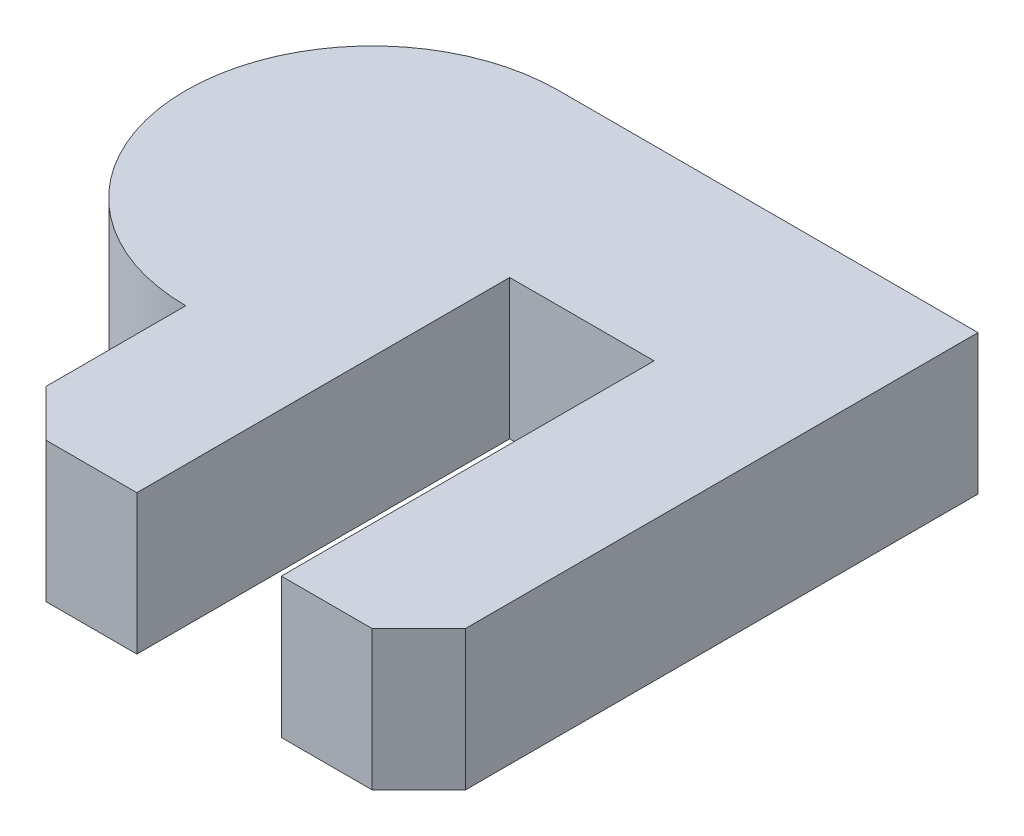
ISO-10303-21;
HEADER;
FILE_DESCRIPTION(('STEP AP214'),'2;1');
FILE_NAME('part.step','',(''),(''),'','','');
FILE_SCHEMA(('AUTOMOTIVE_DESIGN { 1 0 10303 214 1 1 1 1 }'));
ENDSEC;
DATA;
#1=APPLICATION_CONTEXT('core data for automotive mechanical design processes');
#2=APPLICATION_PROTOCOL_DEFINITION('international standard','automotive_design',2000,#1);
#3=PRODUCT_CONTEXT('',#1,'mechanical');
#4=PRODUCT('Part','Part','',(#3));
#5=PRODUCT_RELATED_PRODUCT_CATEGORY('part','',(#4));
#6=PRODUCT_DEFINITION_FORMATION('','',#4);
#7=PRODUCT_DEFINITION_CONTEXT('part definition',#1,'design');
#8=PRODUCT_DEFINITION('design','',#6,#7);
#9=PRODUCT_DEFINITION_SHAPE('','',#8);
#10=(LENGTH_UNIT() NAMED_UNIT(*) SI_UNIT(.MILLI.,.METRE.));
#11=(NAMED_UNIT(*) PLANE_ANGLE_UNIT() SI_UNIT($,.RADIAN.));
#12=(NAMED_UNIT(*) SI_UNIT($,.STERADIAN.) SOLID_ANGLE_UNIT());
#13=UNCERTAINTY_MEASURE_WITH_UNIT(LENGTH_MEASURE(1.E-05),#10,'distance_accuracy_value','');
#14=(GEOMETRIC_REPRESENTATION_CONTEXT(3) GLOBAL_UNCERTAINTY_ASSIGNED_CONTEXT((#13)) GLOBAL_UNIT_ASSIGNED_CONTEXT((#10,
#11,#12)) REPRESENTATION_CONTEXT('',''));
#15=CARTESIAN_POINT('',(0.,0.,0.));
#16=DIRECTION('',(0.,0.,1.));
#17=DIRECTION('',(1.,0.,0.));
#18=AXIS2_PLACEMENT_3D('',#15,#16,#17);
#19=CARTESIAN_POINT('',(4.5,3.,-6.));
#20=DIRECTION('',(0.,-1.,0.));
#21=DIRECTION('',(0.,0.,-1.));
#22=AXIS2_PLACEMENT_3D('',#19,#20,#21);
#23=PLANE('',#22);
#24=DIRECTION('',(-0.707106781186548,0.,0.707106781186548));
#25=VECTOR('',#24,1.);
#26=CARTESIAN_POINT('',(10.,3.,-0.500000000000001));
#27=LINE('',#26,#25);
#28=CARTESIAN_POINT('',(4.5,3.,5.));
#29=VERTEX_POINT('',#28);
#30=CARTESIAN_POINT('',(3.5,3.,6.));
#31=VERTEX_POINT('',#30);
#32=EDGE_CURVE('E116',#29,#31,#27,.T.);
#33=ORIENTED_EDGE('',*,*,#32,.F.);
#34=DIRECTION('',(0.,0.,-1.));
#35=VECTOR('',#34,1.);
#36=CARTESIAN_POINT('',(4.5,3.,6.));
#37=LINE('',#36,#35);
#38=CARTESIAN_POINT('',(4.5,3.,-6.));
#39=VERTEX_POINT('',#38);
#40=EDGE_CURVE('E137',#29,#39,#37,.T.);
#41=ORIENTED_EDGE('',*,*,#40,.T.);
#42=DIRECTION('',(-1.,0.,0.));
#43=VECTOR('',#42,1.);
#44=CARTESIAN_POINT('',(-4.5,3.,-6.));
#45=LINE('',#44,#43);
#46=CARTESIAN_POINT('',(-4.5,3.,-6.));
#47=VERTEX_POINT('',#46);
#48=EDGE_CURVE('E152',#39,#47,#45,.T.);
#49=ORIENTED_EDGE('',*,*,#48,.T.);
#50=CARTESIAN_POINT('',(-4.5,3.,-2.));
#51=DIRECTION('',(0.,1.,0.));
#52=DIRECTION('',(0.,0.,1.));
#53=AXIS2_PLACEMENT_3D('',#50,#51,#52);
#54=CIRCLE('',#53,4.);
#55=CARTESIAN_POINT('',(-4.5,3.,2.));
#56=VERTEX_POINT('',#55);
#57=EDGE_CURVE('E194',#47,#56,#54,.T.);
#58=ORIENTED_EDGE('',*,*,#57,.T.);
#59=DIRECTION('',(0.,0.,1.));
#60=VECTOR('',#59,1.);
#61=CARTESIAN_POINT('',(-4.5,3.,6.));
#62=LINE('',#61,#60);
#63=CARTESIAN_POINT('',(-4.5,3.,5.));
#64=VERTEX_POINT('',#63);
#65=EDGE_CURVE('E163',#56,#64,#62,.T.);
#66=ORIENTED_EDGE('',*,*,#65,.T.);
#67=DIRECTION('',(-0.707106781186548,0.,-0.707106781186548));
#68=VECTOR('',#67,1.);
#69=CARTESIAN_POINT('',(-5.5,3.,4.));
#70=LINE('',#69,#68);
#71=CARTESIAN_POINT('',(-3.5,3.,6.));
#72=VERTEX_POINT('',#71);
#73=EDGE_CURVE('E196',#72,#64,#70,.T.);
#74=ORIENTED_EDGE('',*,*,#73,.F.);
#75=DIRECTION('',(1.,0.,0.));
#76=VECTOR('',#75,1.);
#77=CARTESIAN_POINT('',(-4.5,3.,6.));
#78=LINE('',#77,#76);
#79=CARTESIAN_POINT('',(-1.55,3.,6.));
#80=VERTEX_POINT('',#79);
#81=EDGE_CURVE('E145',#72,#80,#78,.T.);
#82=ORIENTED_EDGE('',*,*,#81,.T.);
#83=DIRECTION('',(0.,0.,1.));
#84=VECTOR('',#83,1.);
#85=CARTESIAN_POINT('',(-1.55,3.,-2.));
#86=LINE('',#85,#84);
#87=CARTESIAN_POINT('',(-1.55,3.,-2.));
#88=VERTEX_POINT('',#87);
#89=EDGE_CURVE('E176',#88,#80,#86,.T.);
#90=ORIENTED_EDGE('',*,*,#89,.F.);
#91=DIRECTION('',(-1.,0.,0.));
#92=VECTOR('',#91,1.);
#93=CARTESIAN_POINT('',(-1.55,3.,-2.));
#94=LINE('',#93,#92);
#95=CARTESIAN_POINT('',(1.55,3.,-2.));
#96=VERTEX_POINT('',#95);
#97=EDGE_CURVE('E189',#96,#88,#94,.T.);
#98=ORIENTED_EDGE('',*,*,#97,.F.);
#99=DIRECTION('',(0.,0.,-1.));
#100=VECTOR('',#99,1.);
#101=CARTESIAN_POINT('',(1.55,3.,-2.));
#102=LINE('',#101,#100);
#103=CARTESIAN_POINT('',(1.55,3.,6.));
#104=VERTEX_POINT('',#103);
#105=EDGE_CURVE('E180',#104,#96,#102,.T.);
#106=ORIENTED_EDGE('',*,*,#105,.F.);
#107=EDGE_CURVE('E162',#104,#31,#78,.T.);
#108=ORIENTED_EDGE('',*,*,#107,.T.);
#109=EDGE_LOOP('',(#33,#41,#49,#58,#66,#74,#82,#90,#98,#106,#108));
#110=FACE_BOUND('',#109,.T.);
#111=ADVANCED_FACE('F33',(#110),#23,.F.);
#112=CARTESIAN_POINT('',(4.5,0.,-6.));
#113=DIRECTION('',(0.,-1.,0.));
#114=DIRECTION('',(0.,0.,-1.));
#115=AXIS2_PLACEMENT_3D('',#112,#113,#114);
#116=PLANE('',#115);
#117=DIRECTION('',(0.,0.,-1.));
#118=VECTOR('',#117,1.);
#119=CARTESIAN_POINT('',(4.5,0.,6.));
#120=LINE('',#119,#118);
#121=CARTESIAN_POINT('',(4.5,0.,5.));
#122=VERTEX_POINT('',#121);
#123=CARTESIAN_POINT('',(4.5,0.,-6.));
#124=VERTEX_POINT('',#123);
#125=EDGE_CURVE('E129',#122,#124,#120,.T.);
#126=ORIENTED_EDGE('',*,*,#125,.F.);
#127=DIRECTION('',(-0.707106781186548,0.,0.707106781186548));
#128=VECTOR('',#127,1.);
#129=CARTESIAN_POINT('',(3.5,0.,6.));
#130=LINE('',#129,#128);
#131=CARTESIAN_POINT('',(3.5,0.,6.));
#132=VERTEX_POINT('',#131);
#133=EDGE_CURVE('E47',#122,#132,#130,.T.);
#134=ORIENTED_EDGE('',*,*,#133,.T.);
#135=DIRECTION('',(1.,0.,0.));
#136=VECTOR('',#135,1.);
#137=CARTESIAN_POINT('',(-4.5,0.,6.));
#138=LINE('',#137,#136);
#139=CARTESIAN_POINT('',(1.55,0.,6.));
#140=VERTEX_POINT('',#139);
#141=EDGE_CURVE('E127',#140,#132,#138,.T.);
#142=ORIENTED_EDGE('',*,*,#141,.F.);
#143=DIRECTION('',(0.,0.,-1.));
#144=VECTOR('',#143,1.);
#145=CARTESIAN_POINT('',(1.55,0.,-2.));
#146=LINE('',#145,#144);
#147=CARTESIAN_POINT('',(1.55,0.,-2.));
#148=VERTEX_POINT('',#147);
#149=EDGE_CURVE('E184',#140,#148,#146,.T.);
#150=ORIENTED_EDGE('',*,*,#149,.T.);
#151=DIRECTION('',(-1.,0.,0.));
#152=VECTOR('',#151,1.);
#153=CARTESIAN_POINT('',(-1.55,0.,-2.));
#154=LINE('',#153,#152);
#155=CARTESIAN_POINT('',(-1.55,0.,-2.));
#156=VERTEX_POINT('',#155);
#157=EDGE_CURVE('E181',#148,#156,#154,.T.);
#158=ORIENTED_EDGE('',*,*,#157,.T.);
#159=DIRECTION('',(0.,0.,1.));
#160=VECTOR('',#159,1.);
#161=CARTESIAN_POINT('',(-1.55,0.,-2.));
#162=LINE('',#161,#160);
#163=CARTESIAN_POINT('',(-1.55,0.,6.));
#164=VERTEX_POINT('',#163);
#165=EDGE_CURVE('E177',#156,#164,#162,.T.);
#166=ORIENTED_EDGE('',*,*,#165,.T.);
#167=CARTESIAN_POINT('',(-3.5,0.,6.));
#168=VERTEX_POINT('',#167);
#169=EDGE_CURVE('E134',#168,#164,#138,.T.);
#170=ORIENTED_EDGE('',*,*,#169,.F.);
#171=DIRECTION('',(-0.707106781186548,0.,-0.707106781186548));
#172=VECTOR('',#171,1.);
#173=CARTESIAN_POINT('',(-3.5,0.,6.));
#174=LINE('',#173,#172);
#175=CARTESIAN_POINT('',(-4.5,0.,5.));
#176=VERTEX_POINT('',#175);
#177=EDGE_CURVE('E204',#168,#176,#174,.T.);
#178=ORIENTED_EDGE('',*,*,#177,.T.);
#179=DIRECTION('',(0.,0.,1.));
#180=VECTOR('',#179,1.);
#181=CARTESIAN_POINT('',(-4.5,0.,6.));
#182=LINE('',#181,#180);
#183=CARTESIAN_POINT('',(-4.5,0.,2.));
#184=VERTEX_POINT('',#183);
#185=EDGE_CURVE('E135',#184,#176,#182,.T.);
#186=ORIENTED_EDGE('',*,*,#185,.F.);
#187=CARTESIAN_POINT('',(-4.5,0.,-2.));
#188=DIRECTION('',(0.,1.,0.));
#189=DIRECTION('',(0.,0.,1.));
#190=AXIS2_PLACEMENT_3D('',#187,#188,#189);
#191=CIRCLE('',#190,4.);
#192=CARTESIAN_POINT('',(-4.5,0.,-6.));
#193=VERTEX_POINT('',#192);
#194=EDGE_CURVE('E159',#193,#184,#191,.T.);
#195=ORIENTED_EDGE('',*,*,#194,.F.);
#196=DIRECTION('',(-1.,0.,0.));
#197=VECTOR('',#196,1.);
#198=CARTESIAN_POINT('',(-4.5,0.,-6.));
#199=LINE('',#198,#197);
#200=EDGE_CURVE('E139',#124,#193,#199,.T.);
#201=ORIENTED_EDGE('',*,*,#200,.F.);
#202=EDGE_LOOP('',(#126,#134,#142,#150,#158,#166,#170,#178,#186,#195,#201));
#203=FACE_BOUND('',#202,.T.);
#204=ADVANCED_FACE('F125',(#203),#116,.T.);
#205=CARTESIAN_POINT('',(-4.5,3.,6.));
#206=DIRECTION('',(0.,0.,-1.));
#207=DIRECTION('',(-1.,0.,0.));
#208=AXIS2_PLACEMENT_3D('',#205,#206,#207);
#209=PLANE('',#208);
#210=DIRECTION('',(0.,-1.,0.));
#211=VECTOR('',#210,1.);
#212=CARTESIAN_POINT('',(3.5,10.,6.));
#213=LINE('',#212,#211);
#214=EDGE_CURVE('E113',#31,#132,#213,.T.);
#215=ORIENTED_EDGE('',*,*,#214,.F.);
#216=ORIENTED_EDGE('',*,*,#107,.F.);
#217=DIRECTION('',(0.,-1.,0.));
#218=VECTOR('',#217,1.);
#219=CARTESIAN_POINT('',(1.55,3.,6.));
#220=LINE('',#219,#218);
#221=EDGE_CURVE('E133',#104,#140,#220,.T.);
#222=ORIENTED_EDGE('',*,*,#221,.T.);
#223=ORIENTED_EDGE('',*,*,#141,.T.);
#224=EDGE_LOOP('',(#215,#216,#222,#223));
#225=FACE_BOUND('',#224,.T.);
#226=ADVANCED_FACE('F132',(#225),#209,.F.);
#227=CARTESIAN_POINT('',(4.5,3.,6.));
#228=DIRECTION('',(-1.,0.,0.));
#229=DIRECTION('',(0.,0.,1.));
#230=AXIS2_PLACEMENT_3D('',#227,#228,#229);
#231=PLANE('',#230);
#232=DIRECTION('',(0.,1.,0.));
#233=VECTOR('',#232,1.);
#234=CARTESIAN_POINT('',(4.5,3.,5.));
#235=LINE('',#234,#233);
#236=EDGE_CURVE('E11',#122,#29,#235,.T.);
#237=ORIENTED_EDGE('',*,*,#236,.F.);
#238=ORIENTED_EDGE('',*,*,#125,.T.);
#239=DIRECTION('',(0.,-1.,0.));
#240=VECTOR('',#239,1.);
#241=CARTESIAN_POINT('',(4.5,3.,-6.));
#242=LINE('',#241,#240);
#243=EDGE_CURVE('E41',#39,#124,#242,.T.);
#244=ORIENTED_EDGE('',*,*,#243,.F.);
#245=ORIENTED_EDGE('',*,*,#40,.F.);
#246=EDGE_LOOP('',(#237,#238,#244,#245));
#247=FACE_BOUND('',#246,.T.);
#248=ADVANCED_FACE('F35',(#247),#231,.F.);
#249=CARTESIAN_POINT('',(-4.5,3.,6.));
#250=DIRECTION('',(1.,0.,0.));
#251=DIRECTION('',(0.,0.,-1.));
#252=AXIS2_PLACEMENT_3D('',#249,#250,#251);
#253=PLANE('',#252);
#254=DIRECTION('',(0.,-1.,0.));
#255=VECTOR('',#254,1.);
#256=CARTESIAN_POINT('',(-4.5,10.,5.));
#257=LINE('',#256,#255);
#258=EDGE_CURVE('E55',#64,#176,#257,.T.);
#259=ORIENTED_EDGE('',*,*,#258,.F.);
#260=ORIENTED_EDGE('',*,*,#65,.F.);
#261=DIRECTION('',(0.,-1.,0.));
#262=VECTOR('',#261,1.);
#263=CARTESIAN_POINT('',(-4.5,3.,2.));
#264=LINE('',#263,#262);
#265=EDGE_CURVE('E186',#56,#184,#264,.T.);
#266=ORIENTED_EDGE('',*,*,#265,.T.);
#267=ORIENTED_EDGE('',*,*,#185,.T.);
#268=EDGE_LOOP('',(#259,#260,#266,#267));
#269=FACE_BOUND('',#268,.T.);
#270=ADVANCED_FACE('F208',(#269),#253,.F.);
#271=DIRECTION('',(0.,-1.,0.));
#272=VECTOR('',#271,1.);
#273=CARTESIAN_POINT('',(-3.5,10.,6.));
#274=LINE('',#273,#272);
#275=EDGE_CURVE('E200',#72,#168,#274,.T.);
#276=ORIENTED_EDGE('',*,*,#275,.T.);
#277=ORIENTED_EDGE('',*,*,#169,.T.);
#278=DIRECTION('',(0.,-1.,0.));
#279=VECTOR('',#278,1.);
#280=CARTESIAN_POINT('',(-1.55,3.,6.));
#281=LINE('',#280,#279);
#282=EDGE_CURVE('E172',#80,#164,#281,.T.);
#283=ORIENTED_EDGE('',*,*,#282,.F.);
#284=ORIENTED_EDGE('',*,*,#81,.F.);
#285=EDGE_LOOP('',(#276,#277,#283,#284));
#286=FACE_BOUND('',#285,.T.);
#287=ADVANCED_FACE('F230',(#286),#209,.F.);
#288=CARTESIAN_POINT('',(-4.5,3.,-6.));
#289=DIRECTION('',(0.,0.,1.));
#290=DIRECTION('',(1.,0.,0.));
#291=AXIS2_PLACEMENT_3D('',#288,#289,#290);
#292=PLANE('',#291);
#293=ORIENTED_EDGE('',*,*,#200,.T.);
#294=DIRECTION('',(0.,-1.,0.));
#295=VECTOR('',#294,1.);
#296=CARTESIAN_POINT('',(-4.5,3.,-6.));
#297=LINE('',#296,#295);
#298=EDGE_CURVE('E143',#47,#193,#297,.T.);
#299=ORIENTED_EDGE('',*,*,#298,.F.);
#300=ORIENTED_EDGE('',*,*,#48,.F.);
#301=ORIENTED_EDGE('',*,*,#243,.T.);
#302=EDGE_LOOP('',(#293,#299,#300,#301));
#303=FACE_BOUND('',#302,.T.);
#304=ADVANCED_FACE('F150',(#303),#292,.F.);
#305=CARTESIAN_POINT('',(1.55,3.,-2.));
#306=DIRECTION('',(-1.,0.,0.));
#307=DIRECTION('',(0.,0.,1.));
#308=AXIS2_PLACEMENT_3D('',#305,#306,#307);
#309=PLANE('',#308);
#310=ORIENTED_EDGE('',*,*,#149,.F.);
#311=ORIENTED_EDGE('',*,*,#221,.F.);
#312=ORIENTED_EDGE('',*,*,#105,.T.);
#313=DIRECTION('',(0.,-1.,0.));
#314=VECTOR('',#313,1.);
#315=CARTESIAN_POINT('',(1.55,3.,-2.));
#316=LINE('',#315,#314);
#317=EDGE_CURVE('E155',#96,#148,#316,.T.);
#318=ORIENTED_EDGE('',*,*,#317,.T.);
#319=EDGE_LOOP('',(#310,#311,#312,#318));
#320=FACE_BOUND('',#319,.T.);
#321=ADVANCED_FACE('F220',(#320),#309,.T.);
#322=CARTESIAN_POINT('',(-1.55,3.,-2.));
#323=DIRECTION('',(0.,0.,1.));
#324=DIRECTION('',(1.,0.,0.));
#325=AXIS2_PLACEMENT_3D('',#322,#323,#324);
#326=PLANE('',#325);
#327=ORIENTED_EDGE('',*,*,#157,.F.);
#328=ORIENTED_EDGE('',*,*,#317,.F.);
#329=ORIENTED_EDGE('',*,*,#97,.T.);
#330=DIRECTION('',(0.,-1.,0.));
#331=VECTOR('',#330,1.);
#332=CARTESIAN_POINT('',(-1.55,3.,-2.));
#333=LINE('',#332,#331);
#334=EDGE_CURVE('E170',#88,#156,#333,.T.);
#335=ORIENTED_EDGE('',*,*,#334,.T.);
#336=EDGE_LOOP('',(#327,#328,#329,#335));
#337=FACE_BOUND('',#336,.T.);
#338=ADVANCED_FACE('F222',(#337),#326,.T.);
#339=CARTESIAN_POINT('',(-1.55,3.,-2.));
#340=DIRECTION('',(1.,0.,0.));
#341=DIRECTION('',(0.,0.,-1.));
#342=AXIS2_PLACEMENT_3D('',#339,#340,#341);
#343=PLANE('',#342);
#344=ORIENTED_EDGE('',*,*,#165,.F.);
#345=ORIENTED_EDGE('',*,*,#334,.F.);
#346=ORIENTED_EDGE('',*,*,#89,.T.);
#347=ORIENTED_EDGE('',*,*,#282,.T.);
#348=EDGE_LOOP('',(#344,#345,#346,#347));
#349=FACE_BOUND('',#348,.T.);
#350=ADVANCED_FACE('F226',(#349),#343,.T.);
#351=CARTESIAN_POINT('',(-4.5,3.,-2.));
#352=DIRECTION('',(0.,-1.,0.));
#353=DIRECTION('',(0.,0.,-1.));
#354=AXIS2_PLACEMENT_3D('',#351,#352,#353);
#355=CYLINDRICAL_SURFACE('',#354,4.);
#356=ORIENTED_EDGE('',*,*,#194,.T.);
#357=ORIENTED_EDGE('',*,*,#265,.F.);
#358=ORIENTED_EDGE('',*,*,#57,.F.);
#359=ORIENTED_EDGE('',*,*,#298,.T.);
#360=EDGE_LOOP('',(#356,#357,#358,#359));
#361=FACE_BOUND('',#360,.T.);
#362=ADVANCED_FACE('F212',(#361),#355,.T.);
#363=CARTESIAN_POINT('',(-3.5,10.,6.));
#364=DIRECTION('',(-0.707106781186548,0.,0.707106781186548));
#365=DIRECTION('',(0.707106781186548,0.,0.707106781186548));
#366=AXIS2_PLACEMENT_3D('',#363,#364,#365);
#367=PLANE('',#366);
#368=ORIENTED_EDGE('',*,*,#73,.T.);
#369=ORIENTED_EDGE('',*,*,#258,.T.);
#370=ORIENTED_EDGE('',*,*,#177,.F.);
#371=ORIENTED_EDGE('',*,*,#275,.F.);
#372=EDGE_LOOP('',(#368,#369,#370,#371));
#373=FACE_BOUND('',#372,.T.);
#374=ADVANCED_FACE('F231',(#373),#367,.T.);
#375=CARTESIAN_POINT('',(3.5,10.,6.));
#376=DIRECTION('',(0.707106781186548,0.,0.707106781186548));
#377=DIRECTION('',(0.707106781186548,0.,-0.707106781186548));
#378=AXIS2_PLACEMENT_3D('',#375,#376,#377);
#379=PLANE('',#378);
#380=ORIENTED_EDGE('',*,*,#32,.T.);
#381=ORIENTED_EDGE('',*,*,#214,.T.);
#382=ORIENTED_EDGE('',*,*,#133,.F.);
#383=ORIENTED_EDGE('',*,*,#236,.T.);
#384=EDGE_LOOP('',(#380,#381,#382,#383));
#385=FACE_BOUND('',#384,.T.);
#386=ADVANCED_FACE('F114',(#385),#379,.T.);
#387=CLOSED_SHELL('',(#111,#204,#226,#248,#270,#287,#304,#321,#338,#350,#362,#374,#386));
#388=MANIFOLD_SOLID_BREP('B2',#387);
#389=ADVANCED_BREP_SHAPE_REPRESENTATION('',(#18,#388),#14);
#390=SHAPE_DEFINITION_REPRESENTATION(#9,#389);
ENDSEC;
END-ISO-10303-21;
